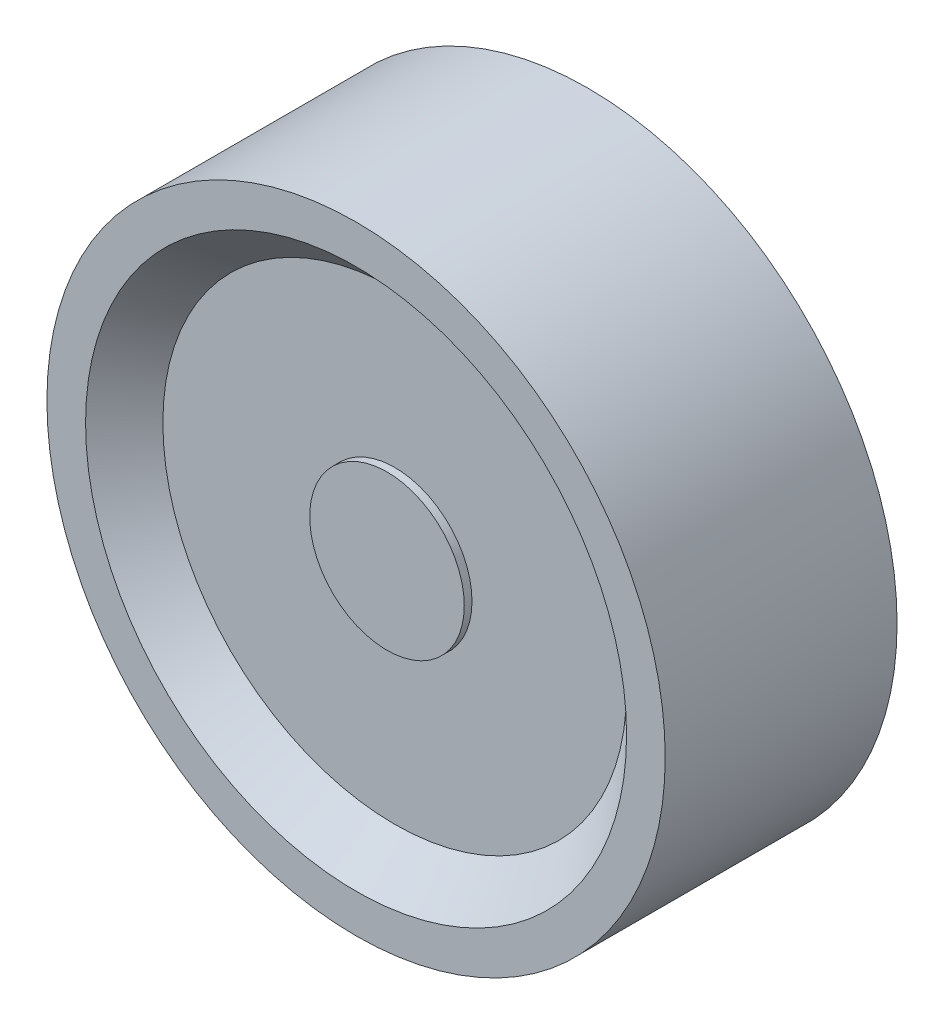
ISO-10303-21;
HEADER;
FILE_DESCRIPTION(('STEP AP214'),'2;1');
FILE_NAME('part.step','',(''),(''),'','','');
FILE_SCHEMA(('AUTOMOTIVE_DESIGN { 1 0 10303 214 1 1 1 1 }'));
ENDSEC;
DATA;
#1=APPLICATION_CONTEXT('core data for automotive mechanical design processes');
#2=APPLICATION_PROTOCOL_DEFINITION('international standard','automotive_design',2000,#1);
#3=PRODUCT_CONTEXT('',#1,'mechanical');
#4=PRODUCT('Part','Part','',(#3));
#5=PRODUCT_RELATED_PRODUCT_CATEGORY('part','',(#4));
#6=PRODUCT_DEFINITION_FORMATION('','',#4);
#7=PRODUCT_DEFINITION_CONTEXT('part definition',#1,'design');
#8=PRODUCT_DEFINITION('design','',#6,#7);
#9=PRODUCT_DEFINITION_SHAPE('','',#8);
#10=(LENGTH_UNIT() NAMED_UNIT(*) SI_UNIT(.MILLI.,.METRE.));
#11=(NAMED_UNIT(*) PLANE_ANGLE_UNIT() SI_UNIT($,.RADIAN.));
#12=(NAMED_UNIT(*) SI_UNIT($,.STERADIAN.) SOLID_ANGLE_UNIT());
#13=UNCERTAINTY_MEASURE_WITH_UNIT(LENGTH_MEASURE(1.E-05),#10,'distance_accuracy_value','');
#14=(GEOMETRIC_REPRESENTATION_CONTEXT(3) GLOBAL_UNCERTAINTY_ASSIGNED_CONTEXT((#13)) GLOBAL_UNIT_ASSIGNED_CONTEXT((#10,
#11,#12)) REPRESENTATION_CONTEXT('',''));
#15=CARTESIAN_POINT('',(0.,0.,0.));
#16=DIRECTION('',(0.,0.,1.));
#17=DIRECTION('',(1.,0.,0.));
#18=AXIS2_PLACEMENT_3D('',#15,#16,#17);
#19=CARTESIAN_POINT('',(0.,0.,0.));
#20=DIRECTION('',(0.,0.,1.));
#21=DIRECTION('',(1.,0.,0.));
#22=AXIS2_PLACEMENT_3D('',#19,#20,#21);
#23=PLANE('',#22);
#24=CARTESIAN_POINT('',(0.,0.,0.));
#25=DIRECTION('',(0.,0.,-1.));
#26=DIRECTION('',(-1.,0.,0.));
#27=AXIS2_PLACEMENT_3D('',#24,#25,#26);
#28=CIRCLE('',#27,2.54);
#29=CARTESIAN_POINT('',(-2.54,0.,0.));
#30=VERTEX_POINT('',#29);
#31=EDGE_CURVE('E90',#30,#30,#28,.T.);
#32=ORIENTED_EDGE('',*,*,#31,.F.);
#33=EDGE_LOOP('',(#32));
#34=FACE_BOUND('',#33,.T.);
#35=CARTESIAN_POINT('',(0.,0.,0.));
#36=DIRECTION('',(0.,0.,1.));
#37=DIRECTION('',(1.,0.,0.));
#38=AXIS2_PLACEMENT_3D('',#35,#36,#37);
#39=CIRCLE('',#38,101.6);
#40=CARTESIAN_POINT('',(-101.6,0.,0.));
#41=VERTEX_POINT('',#40);
#42=EDGE_CURVE('E11',#41,#41,#39,.T.);
#43=ORIENTED_EDGE('',*,*,#42,.F.);
#44=EDGE_LOOP('',(#43));
#45=FACE_BOUND('',#44,.T.);
#46=ADVANCED_FACE('F48',(#34,#45),#23,.F.);
#47=CARTESIAN_POINT('',(0.,0.,0.));
#48=DIRECTION('',(0.,0.,1.));
#49=DIRECTION('',(1.,0.,0.));
#50=AXIS2_PLACEMENT_3D('',#47,#48,#49);
#51=CYLINDRICAL_SURFACE('',#50,101.6);
#52=CARTESIAN_POINT('',(0.,0.,76.2));
#53=DIRECTION('',(0.,0.,1.));
#54=DIRECTION('',(1.,0.,0.));
#55=AXIS2_PLACEMENT_3D('',#52,#53,#54);
#56=CIRCLE('',#55,101.6);
#57=CARTESIAN_POINT('',(-101.6,0.,76.2));
#58=VERTEX_POINT('',#57);
#59=EDGE_CURVE('E95',#58,#58,#56,.T.);
#60=ORIENTED_EDGE('',*,*,#59,.F.);
#61=DIRECTION('',(0.,0.,-1.));
#62=VECTOR('',#61,1.);
#63=CARTESIAN_POINT('',(-101.6,0.,0.));
#64=LINE('',#63,#62);
#65=EDGE_CURVE('E59',#58,#41,#64,.T.);
#66=ORIENTED_EDGE('',*,*,#65,.T.);
#67=ORIENTED_EDGE('',*,*,#42,.T.);
#68=ORIENTED_EDGE('',*,*,#65,.F.);
#69=EDGE_LOOP('',(#60,#66,#67,#68));
#70=FACE_BOUND('',#69,.T.);
#71=ADVANCED_FACE('F50',(#70),#51,.T.);
#72=CARTESIAN_POINT('',(0.,0.,63.5));
#73=DIRECTION('',(0.,0.,1.));
#74=DIRECTION('',(1.,0.,0.));
#75=AXIS2_PLACEMENT_3D('',#72,#73,#74);
#76=PLANE('',#75);
#77=CARTESIAN_POINT('',(0.,0.,63.5));
#78=DIRECTION('',(0.,0.,-1.));
#79=DIRECTION('',(-1.,0.,0.));
#80=AXIS2_PLACEMENT_3D('',#77,#78,#79);
#81=CIRCLE('',#80,25.4000008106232);
#82=CARTESIAN_POINT('',(25.4000008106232,0.,63.5));
#83=VERTEX_POINT('',#82);
#84=EDGE_CURVE('E82',#83,#83,#81,.T.);
#85=ORIENTED_EDGE('',*,*,#84,.T.);
#86=EDGE_LOOP('',(#85));
#87=FACE_BOUND('',#86,.T.);
#88=CARTESIAN_POINT('',(0.,0.,63.5));
#89=DIRECTION('',(0.,0.,-1.));
#90=DIRECTION('',(-1.,0.,0.));
#91=AXIS2_PLACEMENT_3D('',#88,#89,#90);
#92=CIRCLE('',#91,76.2);
#93=CARTESIAN_POINT('',(76.2,0.,63.5));
#94=VERTEX_POINT('',#93);
#95=EDGE_CURVE('E99',#94,#94,#92,.T.);
#96=ORIENTED_EDGE('',*,*,#95,.F.);
#97=EDGE_LOOP('',(#96));
#98=FACE_BOUND('',#97,.T.);
#99=ADVANCED_FACE('F127',(#87,#98),#76,.T.);
#100=CARTESIAN_POINT('',(0.,0.,76.2));
#101=DIRECTION('',(0.,0.,1.));
#102=DIRECTION('',(1.,0.,0.));
#103=AXIS2_PLACEMENT_3D('',#100,#101,#102);
#104=PLANE('',#103);
#105=CARTESIAN_POINT('',(0.,0.,76.2));
#106=DIRECTION('',(0.,0.,1.));
#107=DIRECTION('',(-1.,0.,0.));
#108=AXIS2_PLACEMENT_3D('',#105,#106,#107);
#109=CIRCLE('',#108,88.9);
#110=CARTESIAN_POINT('',(88.9,0.,76.2));
#111=VERTEX_POINT('',#110);
#112=EDGE_CURVE('E100',#111,#111,#109,.T.);
#113=ORIENTED_EDGE('',*,*,#112,.F.);
#114=EDGE_LOOP('',(#113));
#115=FACE_BOUND('',#114,.T.);
#116=ORIENTED_EDGE('',*,*,#59,.T.);
#117=EDGE_LOOP('',(#116));
#118=FACE_BOUND('',#117,.T.);
#119=ADVANCED_FACE('F124',(#115,#118),#104,.T.);
#120=CARTESIAN_POINT('',(0.,0.,69.85));
#121=DIRECTION('',(0.,0.,1.));
#122=DIRECTION('',(-1.,0.,0.));
#123=AXIS2_PLACEMENT_3D('',#120,#121,#122);
#124=CONICAL_SURFACE('',#123,82.55,0.785398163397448);
#125=ORIENTED_EDGE('',*,*,#112,.T.);
#126=DIRECTION('',(-0.707106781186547,0.,-0.707106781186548));
#127=VECTOR('',#126,1.);
#128=CARTESIAN_POINT('',(82.55,0.,69.85));
#129=LINE('',#128,#127);
#130=EDGE_CURVE('E96',#111,#94,#129,.T.);
#131=ORIENTED_EDGE('',*,*,#130,.T.);
#132=ORIENTED_EDGE('',*,*,#95,.T.);
#133=ORIENTED_EDGE('',*,*,#130,.F.);
#134=EDGE_LOOP('',(#125,#131,#132,#133));
#135=FACE_BOUND('',#134,.T.);
#136=ADVANCED_FACE('F126',(#135),#124,.F.);
#137=CARTESIAN_POINT('',(0.,0.,66.04));
#138=DIRECTION('',(0.,0.,1.));
#139=DIRECTION('',(1.,0.,0.));
#140=AXIS2_PLACEMENT_3D('',#137,#138,#139);
#141=PLANE('',#140);
#142=CARTESIAN_POINT('',(0.,0.,66.04));
#143=DIRECTION('',(0.,0.,1.));
#144=DIRECTION('',(-1.,0.,0.));
#145=AXIS2_PLACEMENT_3D('',#142,#143,#144);
#146=CIRCLE('',#145,25.4000008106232);
#147=CARTESIAN_POINT('',(25.4000008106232,0.,66.04));
#148=VERTEX_POINT('',#147);
#149=EDGE_CURVE('E81',#148,#148,#146,.T.);
#150=ORIENTED_EDGE('',*,*,#149,.T.);
#151=EDGE_LOOP('',(#150));
#152=FACE_BOUND('',#151,.T.);
#153=ADVANCED_FACE('F85',(#152),#141,.T.);
#154=CARTESIAN_POINT('',(0.,0.,63.5));
#155=DIRECTION('',(0.,0.,1.));
#156=DIRECTION('',(-1.,0.,0.));
#157=AXIS2_PLACEMENT_3D('',#154,#155,#156);
#158=CYLINDRICAL_SURFACE('',#157,25.4000008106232);
#159=ORIENTED_EDGE('',*,*,#149,.F.);
#160=DIRECTION('',(0.,0.,-1.));
#161=VECTOR('',#160,1.);
#162=CARTESIAN_POINT('',(25.4000008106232,0.,63.5));
#163=LINE('',#162,#161);
#164=EDGE_CURVE('E52',#148,#83,#163,.T.);
#165=ORIENTED_EDGE('',*,*,#164,.T.);
#166=ORIENTED_EDGE('',*,*,#84,.F.);
#167=ORIENTED_EDGE('',*,*,#164,.F.);
#168=EDGE_LOOP('',(#159,#165,#166,#167));
#169=FACE_BOUND('',#168,.T.);
#170=ADVANCED_FACE('F80',(#169),#158,.T.);
#171=CARTESIAN_POINT('',(0.,0.,5.08));
#172=DIRECTION('',(0.,0.,-1.));
#173=DIRECTION('',(-1.,0.,0.));
#174=AXIS2_PLACEMENT_3D('',#171,#172,#173);
#175=CYLINDRICAL_SURFACE('',#174,2.54);
#176=CARTESIAN_POINT('',(0.,0.,5.08));
#177=DIRECTION('',(0.,0.,-1.));
#178=DIRECTION('',(-1.,0.,0.));
#179=AXIS2_PLACEMENT_3D('',#176,#177,#178);
#180=CIRCLE('',#179,2.54);
#181=CARTESIAN_POINT('',(-2.54,0.,5.08));
#182=VERTEX_POINT('',#181);
#183=EDGE_CURVE('E87',#182,#182,#180,.T.);
#184=ORIENTED_EDGE('',*,*,#183,.F.);
#185=EDGE_LOOP('',(#184));
#186=FACE_BOUND('',#185,.T.);
#187=ORIENTED_EDGE('',*,*,#31,.T.);
#188=EDGE_LOOP('',(#187));
#189=FACE_BOUND('',#188,.T.);
#190=ADVANCED_FACE('F117',(#186,#189),#175,.F.);
#191=CARTESIAN_POINT('',(0.,0.,5.08));
#192=DIRECTION('',(0.,0.,-1.));
#193=DIRECTION('',(-1.,0.,0.));
#194=AXIS2_PLACEMENT_3D('',#191,#192,#193);
#195=PLANE('',#194);
#196=ORIENTED_EDGE('',*,*,#183,.T.);
#197=EDGE_LOOP('',(#196));
#198=FACE_BOUND('',#197,.T.);
#199=ADVANCED_FACE('F145',(#198),#195,.T.);
#200=CLOSED_SHELL('',(#46,#71,#99,#119,#136,#153,#170,#190,#199));
#201=MANIFOLD_SOLID_BREP('B2',#200);
#202=ADVANCED_BREP_SHAPE_REPRESENTATION('',(#18,#201),#14);
#203=SHAPE_DEFINITION_REPRESENTATION(#9,#202);
ENDSEC;
END-ISO-10303-21;
